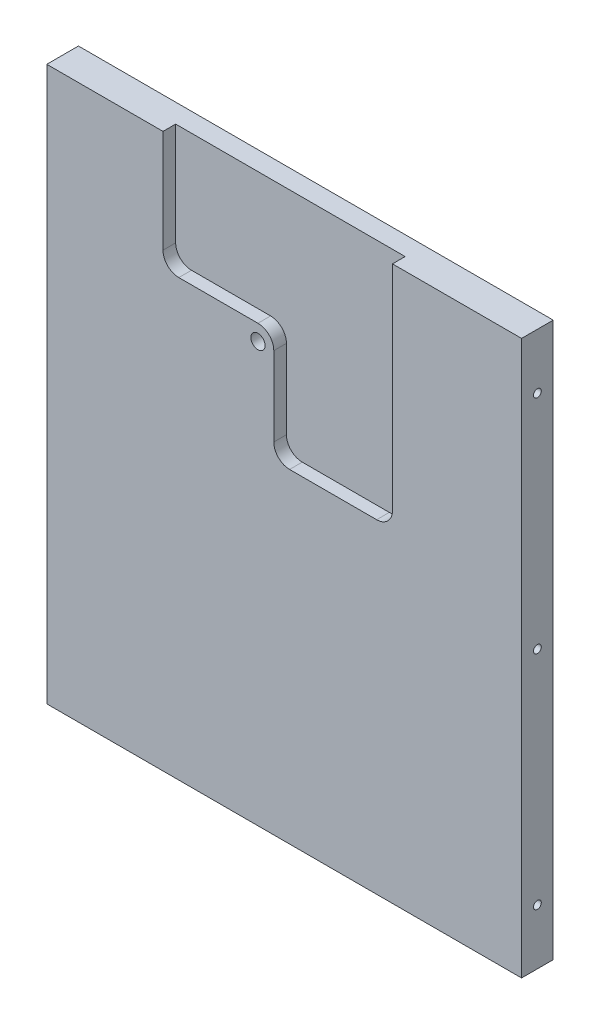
ISO-10303-21;
HEADER;
FILE_DESCRIPTION(('STEP AP214'),'2;1');
FILE_NAME('part.step','',(''),(''),'','','');
FILE_SCHEMA(('AUTOMOTIVE_DESIGN { 1 0 10303 214 1 1 1 1 }'));
ENDSEC;
DATA;
#1=APPLICATION_CONTEXT('core data for automotive mechanical design processes');
#2=APPLICATION_PROTOCOL_DEFINITION('international standard','automotive_design',2000,#1);
#3=PRODUCT_CONTEXT('',#1,'mechanical');
#4=PRODUCT('Part','Part','',(#3));
#5=PRODUCT_RELATED_PRODUCT_CATEGORY('part','',(#4));
#6=PRODUCT_DEFINITION_FORMATION('','',#4);
#7=PRODUCT_DEFINITION_CONTEXT('part definition',#1,'design');
#8=PRODUCT_DEFINITION('design','',#6,#7);
#9=PRODUCT_DEFINITION_SHAPE('','',#8);
#10=(LENGTH_UNIT() NAMED_UNIT(*) SI_UNIT(.MILLI.,.METRE.));
#11=(NAMED_UNIT(*) PLANE_ANGLE_UNIT() SI_UNIT($,.RADIAN.));
#12=(NAMED_UNIT(*) SI_UNIT($,.STERADIAN.) SOLID_ANGLE_UNIT());
#13=UNCERTAINTY_MEASURE_WITH_UNIT(LENGTH_MEASURE(1.E-05),#10,'distance_accuracy_value','');
#14=(GEOMETRIC_REPRESENTATION_CONTEXT(3) GLOBAL_UNCERTAINTY_ASSIGNED_CONTEXT((#13)) GLOBAL_UNIT_ASSIGNED_CONTEXT((#10,
#11,#12)) REPRESENTATION_CONTEXT('',''));
#15=CARTESIAN_POINT('',(0.,0.,0.));
#16=DIRECTION('',(0.,0.,1.));
#17=DIRECTION('',(1.,0.,0.));
#18=AXIS2_PLACEMENT_3D('',#15,#16,#17);
#19=CARTESIAN_POINT('',(-96.1409476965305,69.4002341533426,10.));
#20=DIRECTION('',(1.,0.,0.));
#21=DIRECTION('',(0.,1.,0.));
#22=AXIS2_PLACEMENT_3D('',#19,#20,#21);
#23=PLANE('',#22);
#24=CARTESIAN_POINT('',(-96.1409476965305,51.9002341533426,4.99999999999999));
#25=DIRECTION('',(-1.,0.,0.));
#26=DIRECTION('',(0.,-1.,0.));
#27=AXIS2_PLACEMENT_3D('',#24,#25,#26);
#28=CIRCLE('',#27,1.23);
#29=CARTESIAN_POINT('',(-96.1409476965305,50.6702341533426,4.99999999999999));
#30=VERTEX_POINT('',#29);
#31=EDGE_CURVE('E314',#30,#30,#28,.T.);
#32=ORIENTED_EDGE('',*,*,#31,.F.);
#33=EDGE_LOOP('',(#32));
#34=FACE_BOUND('',#33,.T.);
#35=CARTESIAN_POINT('',(-96.1409476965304,-18.0997658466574,5.));
#36=DIRECTION('',(-1.,0.,0.));
#37=DIRECTION('',(0.,-1.,0.));
#38=AXIS2_PLACEMENT_3D('',#35,#36,#37);
#39=CIRCLE('',#38,1.23);
#40=CARTESIAN_POINT('',(-96.1409476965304,-19.3297658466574,5.));
#41=VERTEX_POINT('',#40);
#42=EDGE_CURVE('E318',#41,#41,#39,.T.);
#43=ORIENTED_EDGE('',*,*,#42,.F.);
#44=EDGE_LOOP('',(#43));
#45=FACE_BOUND('',#44,.T.);
#46=CARTESIAN_POINT('',(-96.1409476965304,-88.0997658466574,4.99999999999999));
#47=DIRECTION('',(-1.,0.,0.));
#48=DIRECTION('',(0.,-1.,0.));
#49=AXIS2_PLACEMENT_3D('',#46,#47,#48);
#50=CIRCLE('',#49,1.23);
#51=CARTESIAN_POINT('',(-96.1409476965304,-89.3297658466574,4.99999999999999));
#52=VERTEX_POINT('',#51);
#53=EDGE_CURVE('E169',#52,#52,#50,.T.);
#54=ORIENTED_EDGE('',*,*,#53,.F.);
#55=EDGE_LOOP('',(#54));
#56=FACE_BOUND('',#55,.T.);
#57=DIRECTION('',(0.,-1.,0.));
#58=VECTOR('',#57,1.);
#59=CARTESIAN_POINT('',(-96.1409476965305,69.4002341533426,0.));
#60=LINE('',#59,#58);
#61=CARTESIAN_POINT('',(-96.1409476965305,69.4002341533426,0.));
#62=VERTEX_POINT('',#61);
#63=CARTESIAN_POINT('',(-96.1409476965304,-105.599765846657,0.));
#64=VERTEX_POINT('',#63);
#65=EDGE_CURVE('E233',#62,#64,#60,.T.);
#66=ORIENTED_EDGE('',*,*,#65,.T.);
#67=DIRECTION('',(0.,0.,-1.));
#68=VECTOR('',#67,1.);
#69=CARTESIAN_POINT('',(-96.1409476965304,-105.599765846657,10.));
#70=LINE('',#69,#68);
#71=CARTESIAN_POINT('',(-96.1409476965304,-105.599765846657,10.));
#72=VERTEX_POINT('',#71);
#73=EDGE_CURVE('E11',#72,#64,#70,.T.);
#74=ORIENTED_EDGE('',*,*,#73,.F.);
#75=DIRECTION('',(0.,-1.,0.));
#76=VECTOR('',#75,1.);
#77=CARTESIAN_POINT('',(-96.1409476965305,69.4002341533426,10.));
#78=LINE('',#77,#76);
#79=CARTESIAN_POINT('',(-96.1409476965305,69.4002341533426,10.));
#80=VERTEX_POINT('',#79);
#81=EDGE_CURVE('E236',#80,#72,#78,.T.);
#82=ORIENTED_EDGE('',*,*,#81,.F.);
#83=DIRECTION('',(0.,0.,-1.));
#84=VECTOR('',#83,1.);
#85=CARTESIAN_POINT('',(-96.1409476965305,69.4002341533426,10.));
#86=LINE('',#85,#84);
#87=EDGE_CURVE('E244',#80,#62,#86,.T.);
#88=ORIENTED_EDGE('',*,*,#87,.T.);
#89=EDGE_LOOP('',(#66,#74,#82,#88));
#90=FACE_BOUND('',#89,.T.);
#91=ADVANCED_FACE('F33',(#34,#45,#56,#90),#23,.F.);
#92=CARTESIAN_POINT('',(-96.1409476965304,-105.599765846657,10.));
#93=DIRECTION('',(0.,1.,0.));
#94=DIRECTION('',(0.,0.,1.));
#95=AXIS2_PLACEMENT_3D('',#92,#93,#94);
#96=PLANE('',#95);
#97=DIRECTION('',(1.,0.,0.));
#98=VECTOR('',#97,1.);
#99=CARTESIAN_POINT('',(-96.1409476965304,-105.599765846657,0.));
#100=LINE('',#99,#98);
#101=CARTESIAN_POINT('',(53.8590523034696,-105.599765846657,0.));
#102=VERTEX_POINT('',#101);
#103=EDGE_CURVE('E247',#64,#102,#100,.T.);
#104=ORIENTED_EDGE('',*,*,#103,.T.);
#105=DIRECTION('',(0.,0.,-1.));
#106=VECTOR('',#105,1.);
#107=CARTESIAN_POINT('',(53.8590523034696,-105.599765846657,10.));
#108=LINE('',#107,#106);
#109=CARTESIAN_POINT('',(53.8590523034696,-105.599765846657,10.));
#110=VERTEX_POINT('',#109);
#111=EDGE_CURVE('E40',#110,#102,#108,.T.);
#112=ORIENTED_EDGE('',*,*,#111,.F.);
#113=DIRECTION('',(1.,0.,0.));
#114=VECTOR('',#113,1.);
#115=CARTESIAN_POINT('',(-96.1409476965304,-105.599765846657,10.));
#116=LINE('',#115,#114);
#117=EDGE_CURVE('E85',#72,#110,#116,.T.);
#118=ORIENTED_EDGE('',*,*,#117,.F.);
#119=ORIENTED_EDGE('',*,*,#73,.T.);
#120=EDGE_LOOP('',(#104,#112,#118,#119));
#121=FACE_BOUND('',#120,.T.);
#122=ADVANCED_FACE('F306',(#121),#96,.F.);
#123=CARTESIAN_POINT('',(53.8590523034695,69.4002341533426,10.));
#124=DIRECTION('',(-1.,0.,0.));
#125=DIRECTION('',(0.,-1.,0.));
#126=AXIS2_PLACEMENT_3D('',#123,#124,#125);
#127=PLANE('',#126);
#128=CARTESIAN_POINT('',(53.8590523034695,51.9002341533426,5.));
#129=DIRECTION('',(1.,0.,0.));
#130=DIRECTION('',(0.,1.,0.));
#131=AXIS2_PLACEMENT_3D('',#128,#129,#130);
#132=CIRCLE('',#131,1.23);
#133=CARTESIAN_POINT('',(53.8590523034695,53.1302341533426,5.));
#134=VERTEX_POINT('',#133);
#135=EDGE_CURVE('E326',#134,#134,#132,.T.);
#136=ORIENTED_EDGE('',*,*,#135,.F.);
#137=EDGE_LOOP('',(#136));
#138=FACE_BOUND('',#137,.T.);
#139=CARTESIAN_POINT('',(53.8590523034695,-18.0997658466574,5.));
#140=DIRECTION('',(1.,0.,0.));
#141=DIRECTION('',(0.,1.,0.));
#142=AXIS2_PLACEMENT_3D('',#139,#140,#141);
#143=CIRCLE('',#142,1.23);
#144=CARTESIAN_POINT('',(53.8590523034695,-16.8697658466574,5.));
#145=VERTEX_POINT('',#144);
#146=EDGE_CURVE('E336',#145,#145,#143,.T.);
#147=ORIENTED_EDGE('',*,*,#146,.F.);
#148=EDGE_LOOP('',(#147));
#149=FACE_BOUND('',#148,.T.);
#150=CARTESIAN_POINT('',(53.8590523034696,-88.0997658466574,5.));
#151=DIRECTION('',(1.,0.,0.));
#152=DIRECTION('',(0.,1.,0.));
#153=AXIS2_PLACEMENT_3D('',#150,#151,#152);
#154=CIRCLE('',#153,1.23);
#155=CARTESIAN_POINT('',(53.8590523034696,-86.8697658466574,5.));
#156=VERTEX_POINT('',#155);
#157=EDGE_CURVE('E342',#156,#156,#154,.T.);
#158=ORIENTED_EDGE('',*,*,#157,.F.);
#159=EDGE_LOOP('',(#158));
#160=FACE_BOUND('',#159,.T.);
#161=DIRECTION('',(0.,1.,0.));
#162=VECTOR('',#161,1.);
#163=CARTESIAN_POINT('',(53.8590523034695,69.4002341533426,0.));
#164=LINE('',#163,#162);
#165=CARTESIAN_POINT('',(53.8590523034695,69.4002341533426,0.));
#166=VERTEX_POINT('',#165);
#167=EDGE_CURVE('E249',#102,#166,#164,.T.);
#168=ORIENTED_EDGE('',*,*,#167,.T.);
#169=DIRECTION('',(0.,0.,-1.));
#170=VECTOR('',#169,1.);
#171=CARTESIAN_POINT('',(53.8590523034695,69.4002341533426,10.));
#172=LINE('',#171,#170);
#173=CARTESIAN_POINT('',(53.8590523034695,69.4002341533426,10.));
#174=VERTEX_POINT('',#173);
#175=EDGE_CURVE('E253',#174,#166,#172,.T.);
#176=ORIENTED_EDGE('',*,*,#175,.F.);
#177=DIRECTION('',(0.,1.,0.));
#178=VECTOR('',#177,1.);
#179=CARTESIAN_POINT('',(53.8590523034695,69.4002341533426,10.));
#180=LINE('',#179,#178);
#181=EDGE_CURVE('E239',#110,#174,#180,.T.);
#182=ORIENTED_EDGE('',*,*,#181,.F.);
#183=ORIENTED_EDGE('',*,*,#111,.T.);
#184=EDGE_LOOP('',(#168,#176,#182,#183));
#185=FACE_BOUND('',#184,.T.);
#186=ADVANCED_FACE('F258',(#138,#149,#160,#185),#127,.F.);
#187=CARTESIAN_POINT('',(-96.1409476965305,69.4002341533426,10.));
#188=DIRECTION('',(0.,-1.,0.));
#189=DIRECTION('',(0.,0.,-1.));
#190=AXIS2_PLACEMENT_3D('',#187,#188,#189);
#191=PLANE('',#190);
#192=DIRECTION('',(-1.,0.,0.));
#193=VECTOR('',#192,1.);
#194=CARTESIAN_POINT('',(-96.1409476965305,69.4002341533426,10.));
#195=LINE('',#194,#193);
#196=CARTESIAN_POINT('',(-59.4257041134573,69.4002341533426,10.));
#197=VERTEX_POINT('',#196);
#198=EDGE_CURVE('E56',#197,#80,#195,.T.);
#199=ORIENTED_EDGE('',*,*,#198,.F.);
#200=DIRECTION('',(0.,0.,1.));
#201=VECTOR('',#200,1.);
#202=CARTESIAN_POINT('',(-59.4257041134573,69.4002341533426,6.));
#203=LINE('',#202,#201);
#204=CARTESIAN_POINT('',(-59.4257041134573,69.4002341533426,6.));
#205=VERTEX_POINT('',#204);
#206=EDGE_CURVE('E214',#205,#197,#203,.T.);
#207=ORIENTED_EDGE('',*,*,#206,.F.);
#208=DIRECTION('',(-1.,0.,0.));
#209=VECTOR('',#208,1.);
#210=CARTESIAN_POINT('',(-59.4257041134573,69.4002341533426,6.));
#211=LINE('',#210,#209);
#212=CARTESIAN_POINT('',(13.0742958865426,69.4002341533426,6.));
#213=VERTEX_POINT('',#212);
#214=EDGE_CURVE('E188',#213,#205,#211,.T.);
#215=ORIENTED_EDGE('',*,*,#214,.F.);
#216=DIRECTION('',(0.,0.,1.));
#217=VECTOR('',#216,1.);
#218=CARTESIAN_POINT('',(13.0742958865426,69.4002341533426,6.));
#219=LINE('',#218,#217);
#220=CARTESIAN_POINT('',(13.0742958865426,69.4002341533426,10.));
#221=VERTEX_POINT('',#220);
#222=EDGE_CURVE('E216',#213,#221,#219,.T.);
#223=ORIENTED_EDGE('',*,*,#222,.T.);
#224=EDGE_CURVE('E241',#174,#221,#195,.T.);
#225=ORIENTED_EDGE('',*,*,#224,.F.);
#226=ORIENTED_EDGE('',*,*,#175,.T.);
#227=DIRECTION('',(-1.,0.,0.));
#228=VECTOR('',#227,1.);
#229=CARTESIAN_POINT('',(-96.1409476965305,69.4002341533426,0.));
#230=LINE('',#229,#228);
#231=EDGE_CURVE('E78',#166,#62,#230,.T.);
#232=ORIENTED_EDGE('',*,*,#231,.T.);
#233=ORIENTED_EDGE('',*,*,#87,.F.);
#234=EDGE_LOOP('',(#199,#207,#215,#223,#225,#226,#232,#233));
#235=FACE_BOUND('',#234,.T.);
#236=ADVANCED_FACE('F266',(#235),#191,.F.);
#237=CARTESIAN_POINT('',(0.,0.,10.));
#238=DIRECTION('',(0.,0.,1.));
#239=DIRECTION('',(1.,0.,0.));
#240=AXIS2_PLACEMENT_3D('',#237,#238,#239);
#241=PLANE('',#240);
#242=DIRECTION('',(0.,-1.,0.));
#243=VECTOR('',#242,1.);
#244=CARTESIAN_POINT('',(-59.4257041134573,36.9002341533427,10.));
#245=LINE('',#244,#243);
#246=CARTESIAN_POINT('',(-59.4257041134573,36.9002341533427,10.));
#247=VERTEX_POINT('',#246);
#248=EDGE_CURVE('E163',#197,#247,#245,.T.);
#249=ORIENTED_EDGE('',*,*,#248,.F.);
#250=ORIENTED_EDGE('',*,*,#198,.T.);
#251=ORIENTED_EDGE('',*,*,#81,.T.);
#252=ORIENTED_EDGE('',*,*,#117,.T.);
#253=ORIENTED_EDGE('',*,*,#181,.T.);
#254=ORIENTED_EDGE('',*,*,#224,.T.);
#255=DIRECTION('',(0.,1.,0.));
#256=VECTOR('',#255,1.);
#257=CARTESIAN_POINT('',(13.0742958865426,1.90023415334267,10.));
#258=LINE('',#257,#256);
#259=CARTESIAN_POINT('',(13.0742958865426,1.90023415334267,10.));
#260=VERTEX_POINT('',#259);
#261=EDGE_CURVE('E166',#260,#221,#258,.T.);
#262=ORIENTED_EDGE('',*,*,#261,.F.);
#263=CARTESIAN_POINT('',(8.07429588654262,1.90023415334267,10.));
#264=DIRECTION('',(0.,0.,1.));
#265=DIRECTION('',(1.,0.,0.));
#266=AXIS2_PLACEMENT_3D('',#263,#264,#265);
#267=CIRCLE('',#266,5.);
#268=CARTESIAN_POINT('',(8.07429588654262,-3.09976584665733,10.));
#269=VERTEX_POINT('',#268);
#270=EDGE_CURVE('E207',#269,#260,#267,.T.);
#271=ORIENTED_EDGE('',*,*,#270,.F.);
#272=DIRECTION('',(1.,0.,0.));
#273=VECTOR('',#272,1.);
#274=CARTESIAN_POINT('',(-19.4257041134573,-3.09976584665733,10.));
#275=LINE('',#274,#273);
#276=CARTESIAN_POINT('',(-19.4257041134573,-3.09976584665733,10.));
#277=VERTEX_POINT('',#276);
#278=EDGE_CURVE('E204',#277,#269,#275,.T.);
#279=ORIENTED_EDGE('',*,*,#278,.F.);
#280=CARTESIAN_POINT('',(-19.4257041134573,1.90023415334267,10.));
#281=DIRECTION('',(0.,0.,1.));
#282=DIRECTION('',(1.,0.,0.));
#283=AXIS2_PLACEMENT_3D('',#280,#281,#282);
#284=CIRCLE('',#283,5.);
#285=CARTESIAN_POINT('',(-24.4257041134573,1.90023415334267,10.));
#286=VERTEX_POINT('',#285);
#287=EDGE_CURVE('E201',#286,#277,#284,.T.);
#288=ORIENTED_EDGE('',*,*,#287,.F.);
#289=DIRECTION('',(0.,-1.,0.));
#290=VECTOR('',#289,1.);
#291=CARTESIAN_POINT('',(-24.4257041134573,26.9002341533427,10.));
#292=LINE('',#291,#290);
#293=CARTESIAN_POINT('',(-24.4257041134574,26.9002341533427,10.));
#294=VERTEX_POINT('',#293);
#295=EDGE_CURVE('E198',#294,#286,#292,.T.);
#296=ORIENTED_EDGE('',*,*,#295,.F.);
#297=CARTESIAN_POINT('',(-29.4257041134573,26.9002341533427,10.));
#298=DIRECTION('',(0.,0.,-1.));
#299=DIRECTION('',(-1.,0.,0.));
#300=AXIS2_PLACEMENT_3D('',#297,#298,#299);
#301=CIRCLE('',#300,5.);
#302=CARTESIAN_POINT('',(-29.4257041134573,31.9002341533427,10.));
#303=VERTEX_POINT('',#302);
#304=EDGE_CURVE('E195',#303,#294,#301,.T.);
#305=ORIENTED_EDGE('',*,*,#304,.F.);
#306=DIRECTION('',(1.,0.,0.));
#307=VECTOR('',#306,1.);
#308=CARTESIAN_POINT('',(-54.4257041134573,31.9002341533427,10.));
#309=LINE('',#308,#307);
#310=CARTESIAN_POINT('',(-54.4257041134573,31.9002341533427,10.));
#311=VERTEX_POINT('',#310);
#312=EDGE_CURVE('E192',#311,#303,#309,.T.);
#313=ORIENTED_EDGE('',*,*,#312,.F.);
#314=CARTESIAN_POINT('',(-54.4257041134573,36.9002341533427,10.));
#315=DIRECTION('',(0.,0.,1.));
#316=DIRECTION('',(-1.,0.,0.));
#317=AXIS2_PLACEMENT_3D('',#314,#315,#316);
#318=CIRCLE('',#317,5.);
#319=EDGE_CURVE('E47',#247,#311,#318,.T.);
#320=ORIENTED_EDGE('',*,*,#319,.F.);
#321=EDGE_LOOP('',(#249,#250,#251,#252,#253,#254,#262,#271,#279,#288,#296,#305,#313,#320));
#322=FACE_BOUND('',#321,.T.);
#323=CARTESIAN_POINT('',(-29.4257041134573,26.9002341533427,10.));
#324=DIRECTION('',(0.,0.,1.));
#325=DIRECTION('',(1.,0.,0.));
#326=AXIS2_PLACEMENT_3D('',#323,#324,#325);
#327=CIRCLE('',#326,2.25);
#328=CARTESIAN_POINT('',(-27.1757041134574,26.9002341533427,10.));
#329=VERTEX_POINT('',#328);
#330=EDGE_CURVE('E213',#329,#329,#327,.T.);
#331=ORIENTED_EDGE('',*,*,#330,.F.);
#332=EDGE_LOOP('',(#331));
#333=FACE_BOUND('',#332,.T.);
#334=ADVANCED_FACE('F271',(#322,#333),#241,.T.);
#335=CARTESIAN_POINT('',(0.,0.,0.));
#336=DIRECTION('',(0.,0.,1.));
#337=DIRECTION('',(1.,0.,0.));
#338=AXIS2_PLACEMENT_3D('',#335,#336,#337);
#339=PLANE('',#338);
#340=CARTESIAN_POINT('',(-29.4257041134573,26.9002341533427,0.));
#341=DIRECTION('',(0.,0.,1.));
#342=DIRECTION('',(1.,0.,0.));
#343=AXIS2_PLACEMENT_3D('',#340,#341,#342);
#344=CIRCLE('',#343,2.25);
#345=CARTESIAN_POINT('',(-27.1757041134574,26.9002341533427,0.));
#346=VERTEX_POINT('',#345);
#347=EDGE_CURVE('E230',#346,#346,#344,.T.);
#348=ORIENTED_EDGE('',*,*,#347,.T.);
#349=EDGE_LOOP('',(#348));
#350=FACE_BOUND('',#349,.T.);
#351=ORIENTED_EDGE('',*,*,#65,.F.);
#352=ORIENTED_EDGE('',*,*,#231,.F.);
#353=ORIENTED_EDGE('',*,*,#167,.F.);
#354=ORIENTED_EDGE('',*,*,#103,.F.);
#355=EDGE_LOOP('',(#351,#352,#353,#354));
#356=FACE_BOUND('',#355,.T.);
#357=ADVANCED_FACE('F262',(#350,#356),#339,.F.);
#358=CARTESIAN_POINT('',(-29.4257041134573,26.9002341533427,0.));
#359=DIRECTION('',(0.,0.,1.));
#360=DIRECTION('',(1.,0.,0.));
#361=AXIS2_PLACEMENT_3D('',#358,#359,#360);
#362=CYLINDRICAL_SURFACE('',#361,2.25);
#363=ORIENTED_EDGE('',*,*,#347,.F.);
#364=EDGE_LOOP('',(#363));
#365=FACE_BOUND('',#364,.T.);
#366=ORIENTED_EDGE('',*,*,#330,.T.);
#367=EDGE_LOOP('',(#366));
#368=FACE_BOUND('',#367,.T.);
#369=ADVANCED_FACE('F387',(#365,#368),#362,.F.);
#370=CARTESIAN_POINT('',(-54.4257041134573,36.9002341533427,6.));
#371=DIRECTION('',(0.,0.,1.));
#372=DIRECTION('',(1.,0.,0.));
#373=AXIS2_PLACEMENT_3D('',#370,#371,#372);
#374=CYLINDRICAL_SURFACE('',#373,5.);
#375=ORIENTED_EDGE('',*,*,#319,.T.);
#376=DIRECTION('',(0.,0.,1.));
#377=VECTOR('',#376,1.);
#378=CARTESIAN_POINT('',(-54.4257041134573,31.9002341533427,6.));
#379=LINE('',#378,#377);
#380=CARTESIAN_POINT('',(-54.4257041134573,31.9002341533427,6.));
#381=VERTEX_POINT('',#380);
#382=EDGE_CURVE('E141',#381,#311,#379,.T.);
#383=ORIENTED_EDGE('',*,*,#382,.F.);
#384=CARTESIAN_POINT('',(-54.4257041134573,36.9002341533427,6.));
#385=DIRECTION('',(0.,0.,1.));
#386=DIRECTION('',(-1.,0.,0.));
#387=AXIS2_PLACEMENT_3D('',#384,#385,#386);
#388=CIRCLE('',#387,5.);
#389=CARTESIAN_POINT('',(-59.4257041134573,36.9002341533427,6.));
#390=VERTEX_POINT('',#389);
#391=EDGE_CURVE('E145',#390,#381,#388,.T.);
#392=ORIENTED_EDGE('',*,*,#391,.F.);
#393=DIRECTION('',(0.,0.,1.));
#394=VECTOR('',#393,1.);
#395=CARTESIAN_POINT('',(-59.4257041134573,36.9002341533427,6.));
#396=LINE('',#395,#394);
#397=EDGE_CURVE('E211',#390,#247,#396,.T.);
#398=ORIENTED_EDGE('',*,*,#397,.T.);
#399=EDGE_LOOP('',(#375,#383,#392,#398));
#400=FACE_BOUND('',#399,.T.);
#401=ADVANCED_FACE('F143',(#400),#374,.F.);
#402=CARTESIAN_POINT('',(-59.4257041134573,36.9002341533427,6.));
#403=DIRECTION('',(-1.,0.,0.));
#404=DIRECTION('',(0.,0.,1.));
#405=AXIS2_PLACEMENT_3D('',#402,#403,#404);
#406=PLANE('',#405);
#407=ORIENTED_EDGE('',*,*,#248,.T.);
#408=ORIENTED_EDGE('',*,*,#397,.F.);
#409=DIRECTION('',(0.,-1.,0.));
#410=VECTOR('',#409,1.);
#411=CARTESIAN_POINT('',(-59.4257041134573,36.9002341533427,6.));
#412=LINE('',#411,#410);
#413=EDGE_CURVE('E151',#205,#390,#412,.T.);
#414=ORIENTED_EDGE('',*,*,#413,.F.);
#415=ORIENTED_EDGE('',*,*,#206,.T.);
#416=EDGE_LOOP('',(#407,#408,#414,#415));
#417=FACE_BOUND('',#416,.T.);
#418=ADVANCED_FACE('F270',(#417),#406,.F.);
#419=CARTESIAN_POINT('',(13.0742958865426,1.90023415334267,6.));
#420=DIRECTION('',(1.,0.,0.));
#421=DIRECTION('',(0.,0.,-1.));
#422=AXIS2_PLACEMENT_3D('',#419,#420,#421);
#423=PLANE('',#422);
#424=ORIENTED_EDGE('',*,*,#261,.T.);
#425=ORIENTED_EDGE('',*,*,#222,.F.);
#426=DIRECTION('',(0.,1.,0.));
#427=VECTOR('',#426,1.);
#428=CARTESIAN_POINT('',(13.0742958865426,1.90023415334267,6.));
#429=LINE('',#428,#427);
#430=CARTESIAN_POINT('',(13.0742958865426,1.90023415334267,6.));
#431=VERTEX_POINT('',#430);
#432=EDGE_CURVE('E185',#431,#213,#429,.T.);
#433=ORIENTED_EDGE('',*,*,#432,.F.);
#434=DIRECTION('',(0.,0.,1.));
#435=VECTOR('',#434,1.);
#436=CARTESIAN_POINT('',(13.0742958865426,1.90023415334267,6.));
#437=LINE('',#436,#435);
#438=EDGE_CURVE('E219',#431,#260,#437,.T.);
#439=ORIENTED_EDGE('',*,*,#438,.T.);
#440=EDGE_LOOP('',(#424,#425,#433,#439));
#441=FACE_BOUND('',#440,.T.);
#442=ADVANCED_FACE('F295',(#441),#423,.F.);
#443=CARTESIAN_POINT('',(8.07429588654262,1.90023415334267,6.));
#444=DIRECTION('',(0.,0.,1.));
#445=DIRECTION('',(1.,0.,0.));
#446=AXIS2_PLACEMENT_3D('',#443,#444,#445);
#447=CYLINDRICAL_SURFACE('',#446,5.);
#448=ORIENTED_EDGE('',*,*,#270,.T.);
#449=ORIENTED_EDGE('',*,*,#438,.F.);
#450=CARTESIAN_POINT('',(8.07429588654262,1.90023415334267,6.));
#451=DIRECTION('',(0.,0.,1.));
#452=DIRECTION('',(1.,0.,0.));
#453=AXIS2_PLACEMENT_3D('',#450,#451,#452);
#454=CIRCLE('',#453,5.);
#455=CARTESIAN_POINT('',(8.07429588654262,-3.09976584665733,6.));
#456=VERTEX_POINT('',#455);
#457=EDGE_CURVE('E182',#456,#431,#454,.T.);
#458=ORIENTED_EDGE('',*,*,#457,.F.);
#459=DIRECTION('',(0.,0.,1.));
#460=VECTOR('',#459,1.);
#461=CARTESIAN_POINT('',(8.07429588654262,-3.09976584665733,6.));
#462=LINE('',#461,#460);
#463=EDGE_CURVE('E221',#456,#269,#462,.T.);
#464=ORIENTED_EDGE('',*,*,#463,.T.);
#465=EDGE_LOOP('',(#448,#449,#458,#464));
#466=FACE_BOUND('',#465,.T.);
#467=ADVANCED_FACE('F291',(#466),#447,.F.);
#468=CARTESIAN_POINT('',(-19.4257041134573,-3.09976584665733,6.));
#469=DIRECTION('',(0.,-1.,0.));
#470=DIRECTION('',(0.,0.,-1.));
#471=AXIS2_PLACEMENT_3D('',#468,#469,#470);
#472=PLANE('',#471);
#473=ORIENTED_EDGE('',*,*,#278,.T.);
#474=ORIENTED_EDGE('',*,*,#463,.F.);
#475=DIRECTION('',(1.,0.,0.));
#476=VECTOR('',#475,1.);
#477=CARTESIAN_POINT('',(-19.4257041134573,-3.09976584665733,6.));
#478=LINE('',#477,#476);
#479=CARTESIAN_POINT('',(-19.4257041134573,-3.09976584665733,6.));
#480=VERTEX_POINT('',#479);
#481=EDGE_CURVE('E179',#480,#456,#478,.T.);
#482=ORIENTED_EDGE('',*,*,#481,.F.);
#483=DIRECTION('',(0.,0.,1.));
#484=VECTOR('',#483,1.);
#485=CARTESIAN_POINT('',(-19.4257041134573,-3.09976584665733,6.));
#486=LINE('',#485,#484);
#487=EDGE_CURVE('E223',#480,#277,#486,.T.);
#488=ORIENTED_EDGE('',*,*,#487,.T.);
#489=EDGE_LOOP('',(#473,#474,#482,#488));
#490=FACE_BOUND('',#489,.T.);
#491=ADVANCED_FACE('F287',(#490),#472,.F.);
#492=CARTESIAN_POINT('',(-19.4257041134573,1.90023415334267,6.));
#493=DIRECTION('',(0.,0.,1.));
#494=DIRECTION('',(1.,0.,0.));
#495=AXIS2_PLACEMENT_3D('',#492,#493,#494);
#496=CYLINDRICAL_SURFACE('',#495,5.);
#497=ORIENTED_EDGE('',*,*,#287,.T.);
#498=ORIENTED_EDGE('',*,*,#487,.F.);
#499=CARTESIAN_POINT('',(-19.4257041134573,1.90023415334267,6.));
#500=DIRECTION('',(0.,0.,1.));
#501=DIRECTION('',(1.,0.,0.));
#502=AXIS2_PLACEMENT_3D('',#499,#500,#501);
#503=CIRCLE('',#502,5.);
#504=CARTESIAN_POINT('',(-24.4257041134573,1.90023415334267,6.));
#505=VERTEX_POINT('',#504);
#506=EDGE_CURVE('E176',#505,#480,#503,.T.);
#507=ORIENTED_EDGE('',*,*,#506,.F.);
#508=DIRECTION('',(0.,0.,1.));
#509=VECTOR('',#508,1.);
#510=CARTESIAN_POINT('',(-24.4257041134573,1.90023415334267,6.));
#511=LINE('',#510,#509);
#512=EDGE_CURVE('E225',#505,#286,#511,.T.);
#513=ORIENTED_EDGE('',*,*,#512,.T.);
#514=EDGE_LOOP('',(#497,#498,#507,#513));
#515=FACE_BOUND('',#514,.T.);
#516=ADVANCED_FACE('F283',(#515),#496,.F.);
#517=CARTESIAN_POINT('',(-24.4257041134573,26.9002341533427,6.));
#518=DIRECTION('',(-1.,0.,0.));
#519=DIRECTION('',(0.,-1.,0.));
#520=AXIS2_PLACEMENT_3D('',#517,#518,#519);
#521=PLANE('',#520);
#522=ORIENTED_EDGE('',*,*,#295,.T.);
#523=ORIENTED_EDGE('',*,*,#512,.F.);
#524=DIRECTION('',(0.,-1.,0.));
#525=VECTOR('',#524,1.);
#526=CARTESIAN_POINT('',(-24.4257041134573,26.9002341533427,6.));
#527=LINE('',#526,#525);
#528=CARTESIAN_POINT('',(-24.4257041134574,26.9002341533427,6.));
#529=VERTEX_POINT('',#528);
#530=EDGE_CURVE('E173',#529,#505,#527,.T.);
#531=ORIENTED_EDGE('',*,*,#530,.F.);
#532=DIRECTION('',(0.,0.,1.));
#533=VECTOR('',#532,1.);
#534=CARTESIAN_POINT('',(-24.4257041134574,26.9002341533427,6.));
#535=LINE('',#534,#533);
#536=EDGE_CURVE('E227',#529,#294,#535,.T.);
#537=ORIENTED_EDGE('',*,*,#536,.T.);
#538=EDGE_LOOP('',(#522,#523,#531,#537));
#539=FACE_BOUND('',#538,.T.);
#540=ADVANCED_FACE('F281',(#539),#521,.F.);
#541=CARTESIAN_POINT('',(-29.4257041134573,26.9002341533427,6.));
#542=DIRECTION('',(0.,0.,1.));
#543=DIRECTION('',(1.,0.,0.));
#544=AXIS2_PLACEMENT_3D('',#541,#542,#543);
#545=CYLINDRICAL_SURFACE('',#544,5.);
#546=ORIENTED_EDGE('',*,*,#304,.T.);
#547=ORIENTED_EDGE('',*,*,#536,.F.);
#548=CARTESIAN_POINT('',(-29.4257041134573,26.9002341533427,6.));
#549=DIRECTION('',(0.,0.,-1.));
#550=DIRECTION('',(-1.,0.,0.));
#551=AXIS2_PLACEMENT_3D('',#548,#549,#550);
#552=CIRCLE('',#551,5.);
#553=CARTESIAN_POINT('',(-29.4257041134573,31.9002341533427,6.));
#554=VERTEX_POINT('',#553);
#555=EDGE_CURVE('E159',#554,#529,#552,.T.);
#556=ORIENTED_EDGE('',*,*,#555,.F.);
#557=DIRECTION('',(0.,0.,1.));
#558=VECTOR('',#557,1.);
#559=CARTESIAN_POINT('',(-29.4257041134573,31.9002341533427,6.));
#560=LINE('',#559,#558);
#561=EDGE_CURVE('E150',#554,#303,#560,.T.);
#562=ORIENTED_EDGE('',*,*,#561,.T.);
#563=EDGE_LOOP('',(#546,#547,#556,#562));
#564=FACE_BOUND('',#563,.T.);
#565=ADVANCED_FACE('F277',(#564),#545,.T.);
#566=CARTESIAN_POINT('',(-54.4257041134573,31.9002341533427,6.));
#567=DIRECTION('',(0.,-1.,0.));
#568=DIRECTION('',(1.,0.,0.));
#569=AXIS2_PLACEMENT_3D('',#566,#567,#568);
#570=PLANE('',#569);
#571=ORIENTED_EDGE('',*,*,#312,.T.);
#572=ORIENTED_EDGE('',*,*,#561,.F.);
#573=DIRECTION('',(1.,0.,0.));
#574=VECTOR('',#573,1.);
#575=CARTESIAN_POINT('',(-54.4257041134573,31.9002341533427,6.));
#576=LINE('',#575,#574);
#577=EDGE_CURVE('E154',#381,#554,#576,.T.);
#578=ORIENTED_EDGE('',*,*,#577,.F.);
#579=ORIENTED_EDGE('',*,*,#382,.T.);
#580=EDGE_LOOP('',(#571,#572,#578,#579));
#581=FACE_BOUND('',#580,.T.);
#582=ADVANCED_FACE('F155',(#581),#570,.F.);
#583=CARTESIAN_POINT('',(-54.4257041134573,36.9002341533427,6.));
#584=DIRECTION('',(0.,0.,-1.));
#585=DIRECTION('',(-1.,0.,0.));
#586=AXIS2_PLACEMENT_3D('',#583,#584,#585);
#587=PLANE('',#586);
#588=ORIENTED_EDGE('',*,*,#391,.T.);
#589=ORIENTED_EDGE('',*,*,#577,.T.);
#590=ORIENTED_EDGE('',*,*,#555,.T.);
#591=ORIENTED_EDGE('',*,*,#530,.T.);
#592=ORIENTED_EDGE('',*,*,#506,.T.);
#593=ORIENTED_EDGE('',*,*,#481,.T.);
#594=ORIENTED_EDGE('',*,*,#457,.T.);
#595=ORIENTED_EDGE('',*,*,#432,.T.);
#596=ORIENTED_EDGE('',*,*,#214,.T.);
#597=ORIENTED_EDGE('',*,*,#413,.T.);
#598=EDGE_LOOP('',(#588,#589,#590,#591,#592,#593,#594,#595,#596,#597));
#599=FACE_BOUND('',#598,.T.);
#600=ADVANCED_FACE('F161',(#599),#587,.F.);
#601=CARTESIAN_POINT('',(-91.1409476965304,-88.0997658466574,4.99999999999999));
#602=DIRECTION('',(-1.,0.,0.));
#603=DIRECTION('',(0.,-1.,0.));
#604=AXIS2_PLACEMENT_3D('',#601,#602,#603);
#605=CYLINDRICAL_SURFACE('',#604,1.23);
#606=CARTESIAN_POINT('',(-91.1409476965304,-88.0997658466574,4.99999999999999));
#607=DIRECTION('',(-1.,0.,0.));
#608=DIRECTION('',(0.,-1.,0.));
#609=AXIS2_PLACEMENT_3D('',#606,#607,#608);
#610=CIRCLE('',#609,1.23);
#611=CARTESIAN_POINT('',(-91.1409476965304,-89.3297658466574,4.99999999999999));
#612=VERTEX_POINT('',#611);
#613=EDGE_CURVE('E322',#612,#612,#610,.T.);
#614=ORIENTED_EDGE('',*,*,#613,.F.);
#615=EDGE_LOOP('',(#614));
#616=FACE_BOUND('',#615,.T.);
#617=ORIENTED_EDGE('',*,*,#53,.T.);
#618=EDGE_LOOP('',(#617));
#619=FACE_BOUND('',#618,.T.);
#620=ADVANCED_FACE('F365',(#616,#619),#605,.F.);
#621=CARTESIAN_POINT('',(-91.1409476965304,-88.0997658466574,4.99999999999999));
#622=DIRECTION('',(-1.,0.,0.));
#623=DIRECTION('',(0.,-1.,0.));
#624=AXIS2_PLACEMENT_3D('',#621,#622,#623);
#625=PLANE('',#624);
#626=ORIENTED_EDGE('',*,*,#613,.T.);
#627=EDGE_LOOP('',(#626));
#628=FACE_BOUND('',#627,.T.);
#629=ADVANCED_FACE('F355',(#628),#625,.T.);
#630=CARTESIAN_POINT('',(-91.1409476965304,-18.0997658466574,5.));
#631=DIRECTION('',(-1.,0.,0.));
#632=DIRECTION('',(0.,-1.,0.));
#633=AXIS2_PLACEMENT_3D('',#630,#631,#632);
#634=CYLINDRICAL_SURFACE('',#633,1.23);
#635=CARTESIAN_POINT('',(-91.1409476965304,-18.0997658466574,5.));
#636=DIRECTION('',(-1.,0.,0.));
#637=DIRECTION('',(0.,-1.,0.));
#638=AXIS2_PLACEMENT_3D('',#635,#636,#637);
#639=CIRCLE('',#638,1.23);
#640=CARTESIAN_POINT('',(-91.1409476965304,-19.3297658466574,5.));
#641=VERTEX_POINT('',#640);
#642=EDGE_CURVE('E348',#641,#641,#639,.T.);
#643=ORIENTED_EDGE('',*,*,#642,.F.);
#644=EDGE_LOOP('',(#643));
#645=FACE_BOUND('',#644,.T.);
#646=ORIENTED_EDGE('',*,*,#42,.T.);
#647=EDGE_LOOP('',(#646));
#648=FACE_BOUND('',#647,.T.);
#649=ADVANCED_FACE('F352',(#645,#648),#634,.F.);
#650=CARTESIAN_POINT('',(-91.1409476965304,-18.0997658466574,5.));
#651=DIRECTION('',(-1.,0.,0.));
#652=DIRECTION('',(0.,-1.,0.));
#653=AXIS2_PLACEMENT_3D('',#650,#651,#652);
#654=PLANE('',#653);
#655=ORIENTED_EDGE('',*,*,#642,.T.);
#656=EDGE_LOOP('',(#655));
#657=FACE_BOUND('',#656,.T.);
#658=ADVANCED_FACE('F354',(#657),#654,.T.);
#659=CARTESIAN_POINT('',(-91.1409476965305,51.9002341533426,4.99999999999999));
#660=DIRECTION('',(-1.,0.,0.));
#661=DIRECTION('',(0.,-1.,0.));
#662=AXIS2_PLACEMENT_3D('',#659,#660,#661);
#663=CYLINDRICAL_SURFACE('',#662,1.23);
#664=CARTESIAN_POINT('',(-91.1409476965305,51.9002341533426,4.99999999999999));
#665=DIRECTION('',(-1.,0.,0.));
#666=DIRECTION('',(0.,-1.,0.));
#667=AXIS2_PLACEMENT_3D('',#664,#665,#666);
#668=CIRCLE('',#667,1.23);
#669=CARTESIAN_POINT('',(-91.1409476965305,50.6702341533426,4.99999999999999));
#670=VERTEX_POINT('',#669);
#671=EDGE_CURVE('E193',#670,#670,#668,.T.);
#672=ORIENTED_EDGE('',*,*,#671,.F.);
#673=EDGE_LOOP('',(#672));
#674=FACE_BOUND('',#673,.T.);
#675=ORIENTED_EDGE('',*,*,#31,.T.);
#676=EDGE_LOOP('',(#675));
#677=FACE_BOUND('',#676,.T.);
#678=ADVANCED_FACE('F362',(#674,#677),#663,.F.);
#679=CARTESIAN_POINT('',(-91.1409476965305,51.9002341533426,4.99999999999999));
#680=DIRECTION('',(-1.,0.,0.));
#681=DIRECTION('',(0.,-1.,0.));
#682=AXIS2_PLACEMENT_3D('',#679,#680,#681);
#683=PLANE('',#682);
#684=ORIENTED_EDGE('',*,*,#671,.T.);
#685=EDGE_LOOP('',(#684));
#686=FACE_BOUND('',#685,.T.);
#687=ADVANCED_FACE('F411',(#686),#683,.T.);
#688=CARTESIAN_POINT('',(48.8590523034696,-88.0997658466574,5.));
#689=DIRECTION('',(1.,0.,0.));
#690=DIRECTION('',(0.,1.,0.));
#691=AXIS2_PLACEMENT_3D('',#688,#689,#690);
#692=CYLINDRICAL_SURFACE('',#691,1.23);
#693=CARTESIAN_POINT('',(48.8590523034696,-88.0997658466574,5.));
#694=DIRECTION('',(1.,0.,0.));
#695=DIRECTION('',(0.,1.,0.));
#696=AXIS2_PLACEMENT_3D('',#693,#694,#695);
#697=CIRCLE('',#696,1.23);
#698=CARTESIAN_POINT('',(48.8590523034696,-86.8697658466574,5.));
#699=VERTEX_POINT('',#698);
#700=EDGE_CURVE('E339',#699,#699,#697,.T.);
#701=ORIENTED_EDGE('',*,*,#700,.F.);
#702=EDGE_LOOP('',(#701));
#703=FACE_BOUND('',#702,.T.);
#704=ORIENTED_EDGE('',*,*,#157,.T.);
#705=EDGE_LOOP('',(#704));
#706=FACE_BOUND('',#705,.T.);
#707=ADVANCED_FACE('F408',(#703,#706),#692,.F.);
#708=CARTESIAN_POINT('',(48.8590523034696,-88.0997658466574,5.));
#709=DIRECTION('',(1.,0.,0.));
#710=DIRECTION('',(0.,1.,0.));
#711=AXIS2_PLACEMENT_3D('',#708,#709,#710);
#712=PLANE('',#711);
#713=ORIENTED_EDGE('',*,*,#700,.T.);
#714=EDGE_LOOP('',(#713));
#715=FACE_BOUND('',#714,.T.);
#716=ADVANCED_FACE('F410',(#715),#712,.T.);
#717=CARTESIAN_POINT('',(48.8590523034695,-18.0997658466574,5.));
#718=DIRECTION('',(1.,0.,0.));
#719=DIRECTION('',(0.,1.,0.));
#720=AXIS2_PLACEMENT_3D('',#717,#718,#719);
#721=CYLINDRICAL_SURFACE('',#720,1.23);
#722=CARTESIAN_POINT('',(48.8590523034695,-18.0997658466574,5.));
#723=DIRECTION('',(1.,0.,0.));
#724=DIRECTION('',(0.,1.,0.));
#725=AXIS2_PLACEMENT_3D('',#722,#723,#724);
#726=CIRCLE('',#725,1.23);
#727=CARTESIAN_POINT('',(48.8590523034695,-16.8697658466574,5.));
#728=VERTEX_POINT('',#727);
#729=EDGE_CURVE('E331',#728,#728,#726,.T.);
#730=ORIENTED_EDGE('',*,*,#729,.F.);
#731=EDGE_LOOP('',(#730));
#732=FACE_BOUND('',#731,.T.);
#733=ORIENTED_EDGE('',*,*,#146,.T.);
#734=EDGE_LOOP('',(#733));
#735=FACE_BOUND('',#734,.T.);
#736=ADVANCED_FACE('F418',(#732,#735),#721,.F.);
#737=CARTESIAN_POINT('',(48.8590523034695,-18.0997658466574,5.));
#738=DIRECTION('',(1.,0.,0.));
#739=DIRECTION('',(0.,1.,0.));
#740=AXIS2_PLACEMENT_3D('',#737,#738,#739);
#741=PLANE('',#740);
#742=ORIENTED_EDGE('',*,*,#729,.T.);
#743=EDGE_LOOP('',(#742));
#744=FACE_BOUND('',#743,.T.);
#745=ADVANCED_FACE('F462',(#744),#741,.T.);
#746=CARTESIAN_POINT('',(48.8590523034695,51.9002341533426,5.));
#747=DIRECTION('',(1.,0.,0.));
#748=DIRECTION('',(0.,1.,0.));
#749=AXIS2_PLACEMENT_3D('',#746,#747,#748);
#750=CYLINDRICAL_SURFACE('',#749,1.23);
#751=CARTESIAN_POINT('',(48.8590523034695,51.9002341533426,5.));
#752=DIRECTION('',(1.,0.,0.));
#753=DIRECTION('',(0.,1.,0.));
#754=AXIS2_PLACEMENT_3D('',#751,#752,#753);
#755=CIRCLE('',#754,1.23);
#756=CARTESIAN_POINT('',(48.8590523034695,53.1302341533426,5.));
#757=VERTEX_POINT('',#756);
#758=EDGE_CURVE('E323',#757,#757,#755,.T.);
#759=ORIENTED_EDGE('',*,*,#758,.F.);
#760=EDGE_LOOP('',(#759));
#761=FACE_BOUND('',#760,.T.);
#762=ORIENTED_EDGE('',*,*,#135,.T.);
#763=EDGE_LOOP('',(#762));
#764=FACE_BOUND('',#763,.T.);
#765=ADVANCED_FACE('F471',(#761,#764),#750,.F.);
#766=CARTESIAN_POINT('',(48.8590523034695,51.9002341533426,5.));
#767=DIRECTION('',(1.,0.,0.));
#768=DIRECTION('',(0.,1.,0.));
#769=AXIS2_PLACEMENT_3D('',#766,#767,#768);
#770=PLANE('',#769);
#771=ORIENTED_EDGE('',*,*,#758,.T.);
#772=EDGE_LOOP('',(#771));
#773=FACE_BOUND('',#772,.T.);
#774=ADVANCED_FACE('F481',(#773),#770,.T.);
#775=CLOSED_SHELL('',(#91,#122,#186,#236,#334,#357,#369,#401,#418,#442,#467,#491,#516,#540,#565,
#582,#600,#620,#629,#649,#658,#678,#687,#707,#716,#736,#745,#765,#774));
#776=MANIFOLD_SOLID_BREP('B2',#775);
#777=ADVANCED_BREP_SHAPE_REPRESENTATION('',(#18,#776),#14);
#778=SHAPE_DEFINITION_REPRESENTATION(#9,#777);
ENDSEC;
END-ISO-10303-21;
